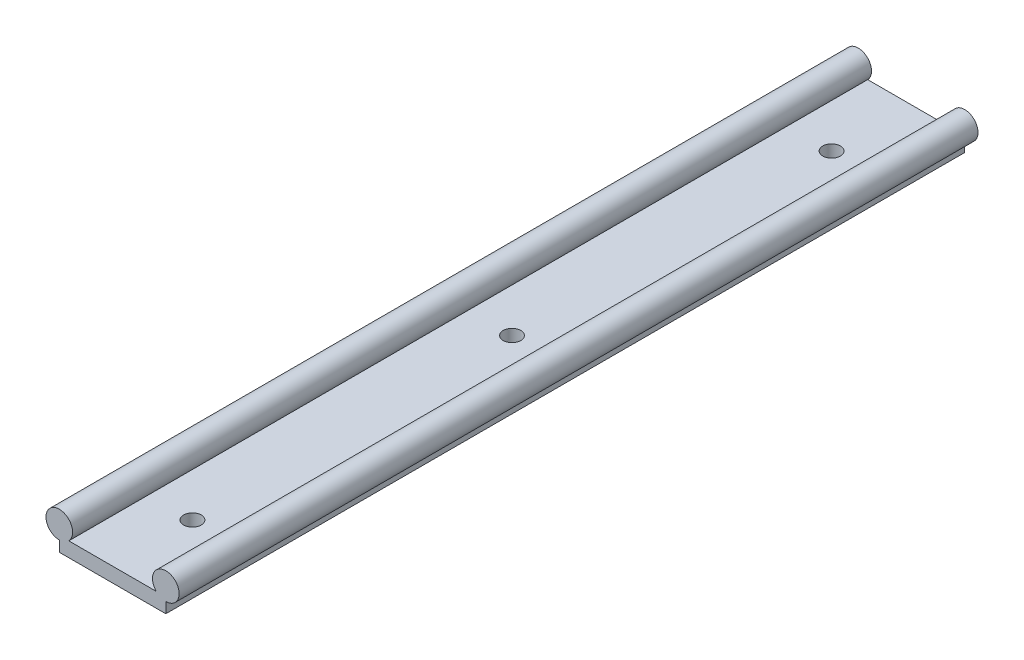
from build123d import *

# Parameters (mm, degrees)
EXTRUIR1_DEPTH                     = 300
TALADRO_DE_DI_METRO_DE_6_6_6_6_1_D = 6.6


with BuildPart() as part:
    # Croquis1 → Extruir1 (new body)
    with BuildSketch(Plane.XY):
        with BuildLine():
            Line((16.429285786, 2.75), (-16.429285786, 2.75))
            ThreePointArc((-16.429285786, 2.75), (-21.936491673, 10.859772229), (-20, 1.25))
            Line((-20, 1.25), (-20, -2.75))
            Line((-20, -2.75), (20, -2.75))
            Line((20, -2.75), (20, 1.25))
            ThreePointArc((20, 1.25), (21.936491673, 10.859772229), (16.429285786, 2.75))
        make_face()
    extrude(amount=EXTRUIR1_DEPTH)

    # Taladro de di_metro de _6.6 _6.6_1 (through all)
    with Locations(Plane(origin=(0, 2.75, 270), x_dir=(1, 0, 0), z_dir=(0, 1, 0))):
        with Locations((0, 0), (0, 120), (0, 240)):
            Hole(TALADRO_DE_DI_METRO_DE_6_6_6_6_1_D / 2)


solid = part.part
